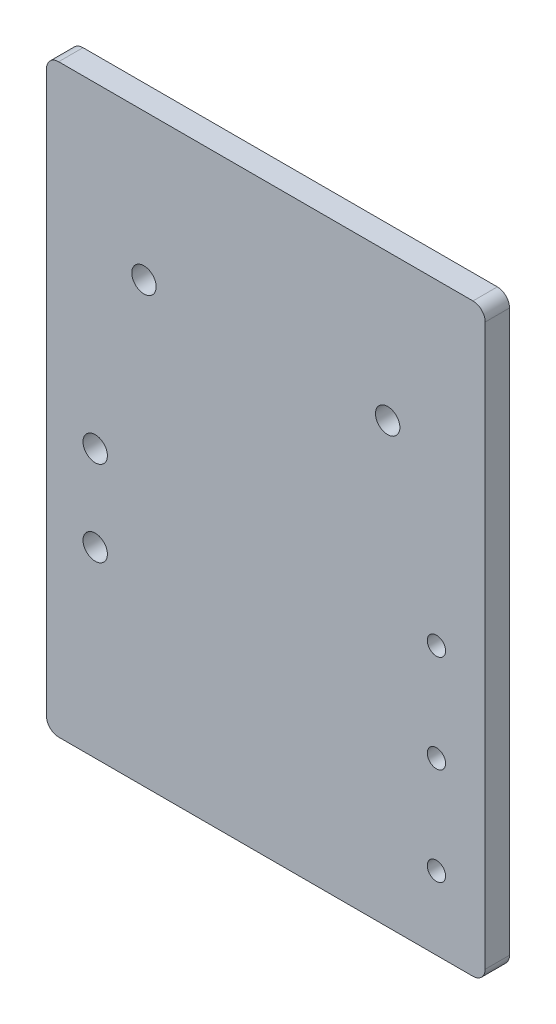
from build123d import *

# Parameters (mm, degrees)
SKETCH1_R           = 3.175
SKETCH1_R_2         = 2.3876
BOSS_EXTRUDE1_DEPTH = 6.35
FILLET1_R           = 3.175


with BuildPart() as part:
    # Sketch1 → Boss-Extrude1 (new body)
    with BuildSketch(Plane.XY):
        Polygon((0, 0), (57.15, 0), (57.15, 152.4), (-57.15, 152.4), (-57.15, 0), align=None)
        with Locations((-31.75, 114.3)):
            Circle(SKETCH1_R, mode=Mode.SUBTRACT)
        with Locations((31.75, 114.3)):
            Circle(SKETCH1_R, mode=Mode.SUBTRACT)
        with Locations((-44.45, 47.625)):
            Circle(SKETCH1_R, mode=Mode.SUBTRACT)
        with Locations((-44.45, 69.85)):
            Circle(SKETCH1_R, mode=Mode.SUBTRACT)
        with Locations((44.45, 19.05)):
            Circle(SKETCH1_R_2, mode=Mode.SUBTRACT)
        with Locations((44.45, 44.45)):
            Circle(SKETCH1_R_2, mode=Mode.SUBTRACT)
        with Locations((44.45, 69.85)):
            Circle(SKETCH1_R_2, mode=Mode.SUBTRACT)
    extrude(amount=BOSS_EXTRUDE1_DEPTH)

    # Fillet1
    fillet1_edges = [part.edges().sort_by_distance(p)[0] for p in [
        (-57.15, 0, 3.175),
        (-57.15, 152.4, 3.175),
        (57.15, 152.4, 3.175),
        (57.15, 0, 3.175),
    ]]
    fillet(fillet1_edges, radius=FILLET1_R)


solid = part.part
